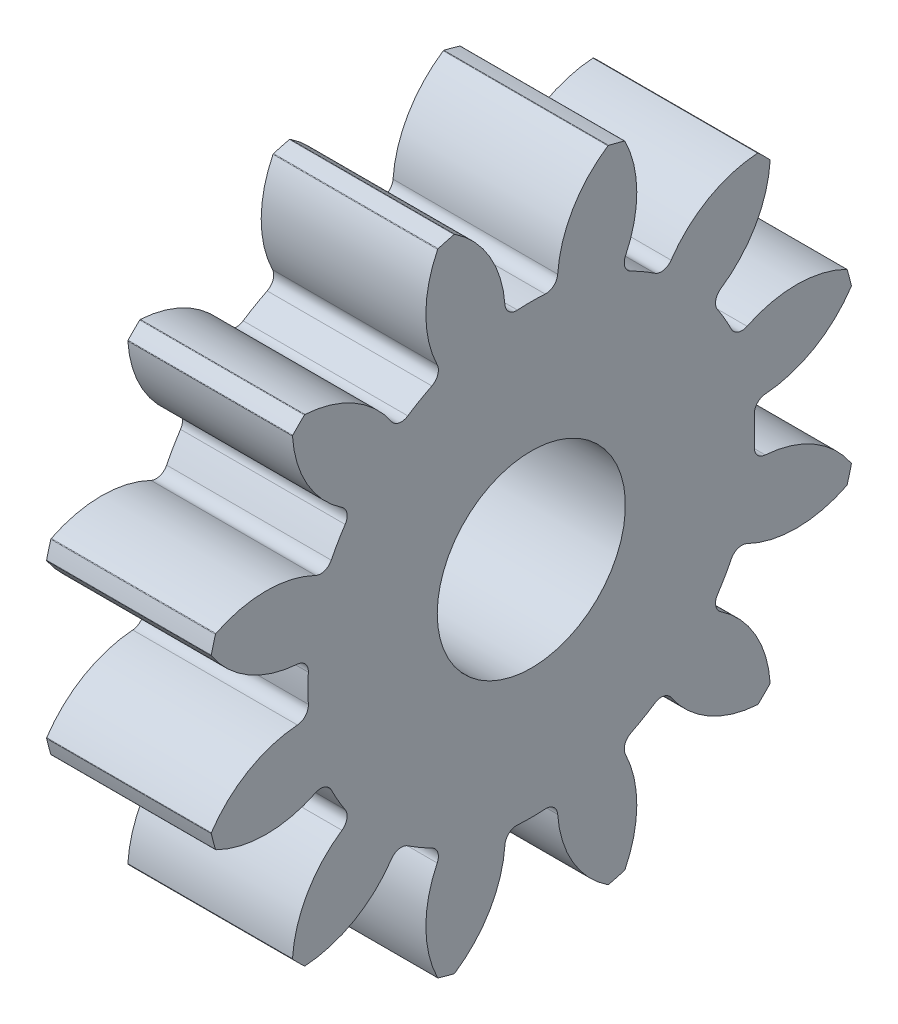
from build123d import *

# Parameters (mm, degrees)
BASPROSKE_W                = 7
BASPROSKE_H                = 14
TOOTHCUT_DEPTH             = 22
BREAKS_R                   = 0.04
ROOTFILLETS_R              = 0.501
TEETHCUTS_COUNT            = 12
TEETHCUTS_ANGLE            = 330
BREAKS_OF_TEETHCUTS_R      = 0.04
ROOTFILLETS_OF_TEETHCUTS_R = 0.501
BORSKE_R                   = 0.4
BORE_DEPTH                 = 50.0000508
SKETCH_1_R                 = 4
CUT_EXTRUDE_1_DEPTH        = 21.480891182


with BuildPart() as part:
    # BasProSke → Base-Revolve (revolve)
    with BuildSketch(Plane(origin=(0, 0, 0), x_dir=(1, 0, 0), z_dir=(0, 1, 0)), mode=Mode.PRIVATE) as base_revolve_sk:
        with Locations((3.5, 7)):
            Rectangle(BASPROSKE_W, BASPROSKE_H)
    revolve(base_revolve_sk.sketch.rotate(Axis((-10, 0, 0), (1, 0, 0)), 180), axis=Axis((-10, 0, 0), (1, 0, 0)))

    # TooCutSke → ToothCut (cut, through all)
    with BuildSketch(Plane(origin=(0, 0, 0), x_dir=(0, 0, -1), z_dir=(1, 0, 0))):
        with BuildLine():
            ThreePointArc((1.111908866, 9.433698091), (0, 9.499), (-1.111908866, 9.433698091))
            ThreePointArc((-1.111908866, 9.433698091), (-1.651516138, 11.821129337), (-3.298149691, 13.632096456))
            ThreePointArc((-3.298149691, 13.632096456), (0, 14.0254), (3.298149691, 13.632096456))
            ThreePointArc((3.298149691, 13.632096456), (1.651516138, 11.821129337), (1.111908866, 9.433698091))
        make_face()
    toothcut = extrude(amount=TOOTHCUT_DEPTH, mode=Mode.SUBTRACT)

    # Breaks
    breaks_edges = [part.edges().sort_by_distance(p)[0] for p in [
        (3.5, 13.613010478, -3.268936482),
        (3.5, 13.613010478, 3.268936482),
    ]]
    fillet(breaks_edges, radius=BREAKS_R)

    # RootFillets
    rootfillets_edges = [part.edges().sort_by_distance(p)[0] for p in [
        (3.5, 9.433698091, -1.111908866),
        (3.5, 9.433698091, 1.111908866),
    ]]
    fillet(rootfillets_edges, radius=ROOTFILLETS_R)

    # TeethCuts: ToothCut ×12 about axis
    teethcuts_axis = Axis((-10, 0, 0), (1, 0, 0))
    for i in range(1, TEETHCUTS_COUNT):
        add(toothcut.rotate(teethcuts_axis, i * TEETHCUTS_ANGLE / (TEETHCUTS_COUNT - 1)), mode=Mode.SUBTRACT)

    # Breaks of TeethCuts
    breaks_of_teethcuts_edges = [part.edges().sort_by_distance(p)[0] for p in [
        (3.5, 13.423681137, 3.975523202),
        (3.5, 10.154744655, 9.637487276),
        (3.5, 9.637487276, 10.154744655),
        (3.5, 3.975523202, 13.423681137),
        (3.5, 3.268936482, 13.613010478),
        (3.5, -3.268936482, 13.613010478),
        (3.5, -3.975523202, 13.423681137),
        (3.5, -9.637487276, 10.154744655),
        (3.5, -10.154744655, 9.637487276),
        (3.5, -13.423681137, 3.975523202),
        (3.5, -13.613010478, 3.268936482),
        (3.5, -13.613010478, -3.268936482),
        (3.5, -13.423681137, -3.975523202),
        (3.5, -10.154744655, -9.637487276),
        (3.5, -9.637487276, -10.154744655),
        (3.5, -3.975523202, -13.423681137),
        (3.5, -3.268936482, -13.613010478),
        (3.5, 3.268936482, -13.613010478),
        (3.5, 3.975523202, -13.423681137),
        (3.5, 9.637487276, -10.154744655),
        (3.5, 10.154744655, -9.637487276),
        (3.5, 13.423681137, -3.975523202),
    ]]
    fillet(breaks_of_teethcuts_edges, radius=BREAKS_OF_TEETHCUTS_R)

    # RootFillets of TeethCuts
    rootfillets_of_teethcuts_edges = [part.edges().sort_by_distance(p)[0] for p in [
        (3.5, 8.725776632, 3.753907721),
        (3.5, 7.613867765, 5.67979037),
        (3.5, 5.67979037, 7.613867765),
        (3.5, 3.753907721, 8.725776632),
        (3.5, 1.111908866, 9.433698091),
        (3.5, -1.111908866, 9.433698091),
        (3.5, -3.753907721, 8.725776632),
        (3.5, -5.67979037, 7.613867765),
        (3.5, -7.613867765, 5.67979037),
        (3.5, -8.725776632, 3.753907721),
        (3.5, -9.433698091, 1.111908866),
        (3.5, -9.433698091, -1.111908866),
        (3.5, -8.725776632, -3.753907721),
        (3.5, -7.613867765, -5.67979037),
        (3.5, -5.67979037, -7.613867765),
        (3.5, -3.753907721, -8.725776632),
        (3.5, -1.111908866, -9.433698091),
        (3.5, 1.111908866, -9.433698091),
        (3.5, 3.753907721, -8.725776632),
        (3.5, 5.67979037, -7.613867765),
        (3.5, 7.613867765, -5.67979037),
        (3.5, 8.725776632, -3.753907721),
    ]]
    fillet(rootfillets_of_teethcuts_edges, radius=ROOTFILLETS_OF_TEETHCUTS_R)

    # BorSke → Bore (cut, symmetric)
    with BuildSketch(Plane(origin=(0, 0, 0), x_dir=(0, 0, -1), z_dir=(1, 0, 0))):
        with Locations(Location((0, 0, 0), (0, 0, 180))):
            Circle(BORSKE_R)
    extrude(amount=BORE_DEPTH, both=True, mode=Mode.SUBTRACT)

    # Sketch 1 → Cut-Extrude 1 (cut, through all)
    with BuildSketch(Plane.ZY):
        Circle(SKETCH_1_R)
    extrude(amount=-CUT_EXTRUDE_1_DEPTH, mode=Mode.SUBTRACT)


solid = part.part
